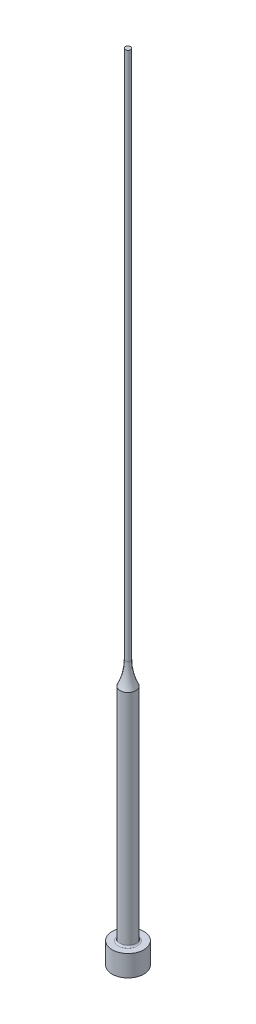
ISO-10303-21;
HEADER;
FILE_DESCRIPTION(('STEP AP214'),'2;1');
FILE_NAME('part.step','',(''),(''),'','','');
FILE_SCHEMA(('AUTOMOTIVE_DESIGN { 1 0 10303 214 1 1 1 1 }'));
ENDSEC;
DATA;
#1=APPLICATION_CONTEXT('core data for automotive mechanical design processes');
#2=APPLICATION_PROTOCOL_DEFINITION('international standard','automotive_design',2000,#1);
#3=PRODUCT_CONTEXT('',#1,'mechanical');
#4=PRODUCT('Part','Part','',(#3));
#5=PRODUCT_RELATED_PRODUCT_CATEGORY('part','',(#4));
#6=PRODUCT_DEFINITION_FORMATION('','',#4);
#7=PRODUCT_DEFINITION_CONTEXT('part definition',#1,'design');
#8=PRODUCT_DEFINITION('design','',#6,#7);
#9=PRODUCT_DEFINITION_SHAPE('','',#8);
#10=(LENGTH_UNIT() NAMED_UNIT(*) SI_UNIT(.MILLI.,.METRE.));
#11=(NAMED_UNIT(*) PLANE_ANGLE_UNIT() SI_UNIT($,.RADIAN.));
#12=(NAMED_UNIT(*) SI_UNIT($,.STERADIAN.) SOLID_ANGLE_UNIT());
#13=UNCERTAINTY_MEASURE_WITH_UNIT(LENGTH_MEASURE(1.E-05),#10,'distance_accuracy_value','');
#14=(GEOMETRIC_REPRESENTATION_CONTEXT(3) GLOBAL_UNCERTAINTY_ASSIGNED_CONTEXT((#13)) GLOBAL_UNIT_ASSIGNED_CONTEXT((#10,
#11,#12)) REPRESENTATION_CONTEXT('',''));
#15=CARTESIAN_POINT('',(0.,0.,0.));
#16=DIRECTION('',(0.,0.,1.));
#17=DIRECTION('',(1.,0.,0.));
#18=AXIS2_PLACEMENT_3D('',#15,#16,#17);
#19=CARTESIAN_POINT('',(0.500000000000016,150.,0.));
#20=DIRECTION('',(0.,-1.,0.));
#21=DIRECTION('',(1.,0.,0.));
#22=AXIS2_PLACEMENT_3D('',#19,#20,#21);
#23=PLANE('',#22);
#24=CARTESIAN_POINT('',(0.,150.,0.));
#25=DIRECTION('',(0.,1.,0.));
#26=DIRECTION('',(-1.,0.,0.));
#27=AXIS2_PLACEMENT_3D('',#24,#25,#26);
#28=CIRCLE('',#27,0.500000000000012);
#29=CARTESIAN_POINT('',(-0.500000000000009,150.,0.));
#30=VERTEX_POINT('',#29);
#31=EDGE_CURVE('E10',#30,#30,#28,.T.);
#32=ORIENTED_EDGE('',*,*,#31,.T.);
#33=EDGE_LOOP('',(#32));
#34=FACE_BOUND('',#33,.T.);
#35=ADVANCED_FACE('F30',(#34),#23,.F.);
#36=CARTESIAN_POINT('',(0.,150.,0.));
#37=DIRECTION('',(0.,1.,0.));
#38=DIRECTION('',(-1.,0.,0.));
#39=AXIS2_PLACEMENT_3D('',#36,#37,#38);
#40=CYLINDRICAL_SURFACE('',#39,0.500000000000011);
#41=ORIENTED_EDGE('',*,*,#31,.F.);
#42=EDGE_LOOP('',(#41));
#43=FACE_BOUND('',#42,.T.);
#44=CARTESIAN_POINT('',(0.,50.,0.));
#45=DIRECTION('',(0.,1.,0.));
#46=DIRECTION('',(-1.,0.,0.));
#47=AXIS2_PLACEMENT_3D('',#44,#45,#46);
#48=CIRCLE('',#47,0.50000000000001);
#49=CARTESIAN_POINT('',(-0.500000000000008,50.,0.));
#50=VERTEX_POINT('',#49);
#51=EDGE_CURVE('E36',#50,#50,#48,.T.);
#52=ORIENTED_EDGE('',*,*,#51,.T.);
#53=EDGE_LOOP('',(#52));
#54=FACE_BOUND('',#53,.T.);
#55=ADVANCED_FACE('F71',(#43,#54),#40,.T.);
#56=CARTESIAN_POINT('',(0.,50.,0.));
#57=DIRECTION('',(0.,1.,0.));
#58=DIRECTION('',(-1.,0.,0.));
#59=AXIS2_PLACEMENT_3D('',#56,#57,#58);
#60=TOROIDAL_SURFACE('',#59,10.5,10.);
#61=ORIENTED_EDGE('',*,*,#51,.F.);
#62=EDGE_LOOP('',(#61));
#63=FACE_BOUND('',#62,.T.);
#64=CARTESIAN_POINT('',(0.,45.6411010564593,0.));
#65=DIRECTION('',(0.,1.,0.));
#66=DIRECTION('',(-1.,0.,0.));
#67=AXIS2_PLACEMENT_3D('',#64,#65,#66);
#68=CIRCLE('',#67,1.50000000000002);
#69=CARTESIAN_POINT('',(-1.50000000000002,45.6411010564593,0.));
#70=VERTEX_POINT('',#69);
#71=EDGE_CURVE('E40',#70,#70,#68,.T.);
#72=ORIENTED_EDGE('',*,*,#71,.T.);
#73=EDGE_LOOP('',(#72));
#74=FACE_BOUND('',#73,.T.);
#75=ADVANCED_FACE('F75',(#63,#74),#60,.F.);
#76=CARTESIAN_POINT('',(0.,150.,0.));
#77=DIRECTION('',(0.,1.,0.));
#78=DIRECTION('',(-1.,0.,0.));
#79=AXIS2_PLACEMENT_3D('',#76,#77,#78);
#80=CYLINDRICAL_SURFACE('',#79,1.50000000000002);
#81=ORIENTED_EDGE('',*,*,#71,.F.);
#82=EDGE_LOOP('',(#81));
#83=FACE_BOUND('',#82,.T.);
#84=CARTESIAN_POINT('',(0.,4.3,0.));
#85=DIRECTION('',(0.,1.,0.));
#86=DIRECTION('',(-1.,0.,0.));
#87=AXIS2_PLACEMENT_3D('',#84,#85,#86);
#88=CIRCLE('',#87,1.50000000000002);
#89=CARTESIAN_POINT('',(-1.50000000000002,4.3,0.));
#90=VERTEX_POINT('',#89);
#91=EDGE_CURVE('E44',#90,#90,#88,.T.);
#92=ORIENTED_EDGE('',*,*,#91,.T.);
#93=EDGE_LOOP('',(#92));
#94=FACE_BOUND('',#93,.T.);
#95=ADVANCED_FACE('F80',(#83,#94),#80,.T.);
#96=CARTESIAN_POINT('',(0.,4.3,0.));
#97=DIRECTION('',(0.,1.,0.));
#98=DIRECTION('',(-1.,0.,0.));
#99=AXIS2_PLACEMENT_3D('',#96,#97,#98);
#100=TOROIDAL_SURFACE('',#99,1.80000000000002,0.3);
#101=ORIENTED_EDGE('',*,*,#91,.F.);
#102=EDGE_LOOP('',(#101));
#103=FACE_BOUND('',#102,.T.);
#104=CARTESIAN_POINT('',(0.,4.,0.));
#105=DIRECTION('',(0.,1.,0.));
#106=DIRECTION('',(-1.,0.,0.));
#107=AXIS2_PLACEMENT_3D('',#104,#105,#106);
#108=CIRCLE('',#107,1.80000000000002);
#109=CARTESIAN_POINT('',(-1.80000000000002,4.,0.));
#110=VERTEX_POINT('',#109);
#111=EDGE_CURVE('E49',#110,#110,#108,.T.);
#112=ORIENTED_EDGE('',*,*,#111,.T.);
#113=EDGE_LOOP('',(#112));
#114=FACE_BOUND('',#113,.T.);
#115=ADVANCED_FACE('F86',(#103,#114),#100,.F.);
#116=CARTESIAN_POINT('',(3.00000000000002,4.,0.));
#117=DIRECTION('',(0.,-1.,0.));
#118=DIRECTION('',(1.,0.,0.));
#119=AXIS2_PLACEMENT_3D('',#116,#117,#118);
#120=PLANE('',#119);
#121=ORIENTED_EDGE('',*,*,#111,.F.);
#122=EDGE_LOOP('',(#121));
#123=FACE_BOUND('',#122,.T.);
#124=CARTESIAN_POINT('',(0.,4.,0.));
#125=DIRECTION('',(0.,1.,0.));
#126=DIRECTION('',(-1.,0.,0.));
#127=AXIS2_PLACEMENT_3D('',#124,#125,#126);
#128=CIRCLE('',#127,3.00000000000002);
#129=CARTESIAN_POINT('',(-3.00000000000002,4.,0.));
#130=VERTEX_POINT('',#129);
#131=EDGE_CURVE('E52',#130,#130,#128,.T.);
#132=ORIENTED_EDGE('',*,*,#131,.T.);
#133=EDGE_LOOP('',(#132));
#134=FACE_BOUND('',#133,.T.);
#135=ADVANCED_FACE('F67',(#123,#134),#120,.F.);
#136=CARTESIAN_POINT('',(0.,150.,0.));
#137=DIRECTION('',(0.,1.,0.));
#138=DIRECTION('',(-1.,0.,0.));
#139=AXIS2_PLACEMENT_3D('',#136,#137,#138);
#140=CYLINDRICAL_SURFACE('',#139,3.00000000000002);
#141=ORIENTED_EDGE('',*,*,#131,.F.);
#142=EDGE_LOOP('',(#141));
#143=FACE_BOUND('',#142,.T.);
#144=CARTESIAN_POINT('',(0.,0.,0.));
#145=DIRECTION('',(0.,1.,0.));
#146=DIRECTION('',(-1.,0.,0.));
#147=AXIS2_PLACEMENT_3D('',#144,#145,#146);
#148=CIRCLE('',#147,3.00000000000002);
#149=CARTESIAN_POINT('',(-3.00000000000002,0.,0.));
#150=VERTEX_POINT('',#149);
#151=EDGE_CURVE('E55',#150,#150,#148,.T.);
#152=ORIENTED_EDGE('',*,*,#151,.T.);
#153=EDGE_LOOP('',(#152));
#154=FACE_BOUND('',#153,.T.);
#155=ADVANCED_FACE('F59',(#143,#154),#140,.T.);
#156=CARTESIAN_POINT('',(0.,0.,0.));
#157=DIRECTION('',(0.,1.,0.));
#158=DIRECTION('',(-1.,0.,0.));
#159=AXIS2_PLACEMENT_3D('',#156,#157,#158);
#160=PLANE('',#159);
#161=ORIENTED_EDGE('',*,*,#151,.F.);
#162=EDGE_LOOP('',(#161));
#163=FACE_BOUND('',#162,.T.);
#164=ADVANCED_FACE('F61',(#163),#160,.F.);
#165=CLOSED_SHELL('',(#35,#55,#75,#95,#115,#135,#155,#164));
#166=MANIFOLD_SOLID_BREP('B2',#165);
#167=ADVANCED_BREP_SHAPE_REPRESENTATION('',(#18,#166),#14);
#168=SHAPE_DEFINITION_REPRESENTATION(#9,#167);
ENDSEC;
END-ISO-10303-21;
